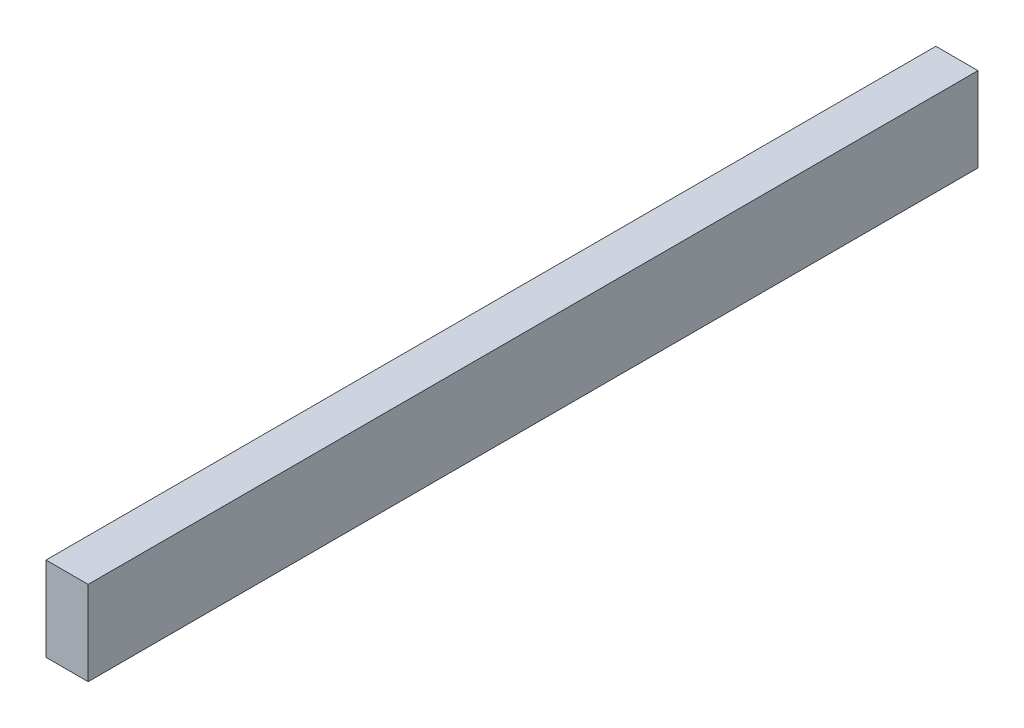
ISO-10303-21;
HEADER;
FILE_DESCRIPTION(('STEP AP214'),'2;1');
FILE_NAME('part.step','',(''),(''),'','','');
FILE_SCHEMA(('AUTOMOTIVE_DESIGN { 1 0 10303 214 1 1 1 1 }'));
ENDSEC;
DATA;
#1=APPLICATION_CONTEXT('core data for automotive mechanical design processes');
#2=APPLICATION_PROTOCOL_DEFINITION('international standard','automotive_design',2000,#1);
#3=PRODUCT_CONTEXT('',#1,'mechanical');
#4=PRODUCT('Part','Part','',(#3));
#5=PRODUCT_RELATED_PRODUCT_CATEGORY('part','',(#4));
#6=PRODUCT_DEFINITION_FORMATION('','',#4);
#7=PRODUCT_DEFINITION_CONTEXT('part definition',#1,'design');
#8=PRODUCT_DEFINITION('design','',#6,#7);
#9=PRODUCT_DEFINITION_SHAPE('','',#8);
#10=(LENGTH_UNIT() NAMED_UNIT(*) SI_UNIT(.MILLI.,.METRE.));
#11=(NAMED_UNIT(*) PLANE_ANGLE_UNIT() SI_UNIT($,.RADIAN.));
#12=(NAMED_UNIT(*) SI_UNIT($,.STERADIAN.) SOLID_ANGLE_UNIT());
#13=UNCERTAINTY_MEASURE_WITH_UNIT(LENGTH_MEASURE(1.E-05),#10,'distance_accuracy_value','');
#14=(GEOMETRIC_REPRESENTATION_CONTEXT(3) GLOBAL_UNCERTAINTY_ASSIGNED_CONTEXT((#13)) GLOBAL_UNIT_ASSIGNED_CONTEXT((#10,
#11,#12)) REPRESENTATION_CONTEXT('',''));
#15=CARTESIAN_POINT('',(0.,0.,0.));
#16=DIRECTION('',(0.,0.,1.));
#17=DIRECTION('',(1.,0.,0.));
#18=AXIS2_PLACEMENT_3D('',#15,#16,#17);
#19=CARTESIAN_POINT('',(10.,20.,422.2));
#20=DIRECTION('',(-1.,0.,0.));
#21=DIRECTION('',(0.,-1.,0.));
#22=AXIS2_PLACEMENT_3D('',#19,#20,#21);
#23=PLANE('',#22);
#24=DIRECTION('',(0.,1.,0.));
#25=VECTOR('',#24,1.);
#26=CARTESIAN_POINT('',(10.,20.,0.));
#27=LINE('',#26,#25);
#28=CARTESIAN_POINT('',(10.,-20.,0.));
#29=VERTEX_POINT('',#28);
#30=CARTESIAN_POINT('',(10.,20.,0.));
#31=VERTEX_POINT('',#30);
#32=EDGE_CURVE('E78',#29,#31,#27,.T.);
#33=ORIENTED_EDGE('',*,*,#32,.T.);
#34=DIRECTION('',(0.,0.,-1.));
#35=VECTOR('',#34,1.);
#36=CARTESIAN_POINT('',(10.,20.,422.2));
#37=LINE('',#36,#35);
#38=CARTESIAN_POINT('',(10.,20.,422.2));
#39=VERTEX_POINT('',#38);
#40=EDGE_CURVE('E11',#39,#31,#37,.T.);
#41=ORIENTED_EDGE('',*,*,#40,.F.);
#42=DIRECTION('',(0.,1.,0.));
#43=VECTOR('',#42,1.);
#44=CARTESIAN_POINT('',(10.,20.,422.2));
#45=LINE('',#44,#43);
#46=CARTESIAN_POINT('',(10.,-20.,422.2));
#47=VERTEX_POINT('',#46);
#48=EDGE_CURVE('E70',#47,#39,#45,.T.);
#49=ORIENTED_EDGE('',*,*,#48,.F.);
#50=DIRECTION('',(0.,0.,-1.));
#51=VECTOR('',#50,1.);
#52=CARTESIAN_POINT('',(10.,-20.,422.2));
#53=LINE('',#52,#51);
#54=EDGE_CURVE('E74',#47,#29,#53,.T.);
#55=ORIENTED_EDGE('',*,*,#54,.T.);
#56=EDGE_LOOP('',(#33,#41,#49,#55));
#57=FACE_BOUND('',#56,.T.);
#58=ADVANCED_FACE('F16',(#57),#23,.F.);
#59=CARTESIAN_POINT('',(-10.,20.,422.2));
#60=DIRECTION('',(0.,-1.,0.));
#61=DIRECTION('',(0.,0.,-1.));
#62=AXIS2_PLACEMENT_3D('',#59,#60,#61);
#63=PLANE('',#62);
#64=DIRECTION('',(-1.,0.,0.));
#65=VECTOR('',#64,1.);
#66=CARTESIAN_POINT('',(-10.,20.,0.));
#67=LINE('',#66,#65);
#68=CARTESIAN_POINT('',(-10.,20.,0.));
#69=VERTEX_POINT('',#68);
#70=EDGE_CURVE('E75',#31,#69,#67,.T.);
#71=ORIENTED_EDGE('',*,*,#70,.T.);
#72=DIRECTION('',(0.,0.,-1.));
#73=VECTOR('',#72,1.);
#74=CARTESIAN_POINT('',(-10.,20.,422.2));
#75=LINE('',#74,#73);
#76=CARTESIAN_POINT('',(-10.,20.,422.2));
#77=VERTEX_POINT('',#76);
#78=EDGE_CURVE('E24',#77,#69,#75,.T.);
#79=ORIENTED_EDGE('',*,*,#78,.F.);
#80=DIRECTION('',(-1.,0.,0.));
#81=VECTOR('',#80,1.);
#82=CARTESIAN_POINT('',(-10.,20.,422.2));
#83=LINE('',#82,#81);
#84=EDGE_CURVE('E62',#39,#77,#83,.T.);
#85=ORIENTED_EDGE('',*,*,#84,.F.);
#86=ORIENTED_EDGE('',*,*,#40,.T.);
#87=EDGE_LOOP('',(#71,#79,#85,#86));
#88=FACE_BOUND('',#87,.T.);
#89=ADVANCED_FACE('F69',(#88),#63,.F.);
#90=CARTESIAN_POINT('',(-10.,20.,422.2));
#91=DIRECTION('',(1.,0.,0.));
#92=DIRECTION('',(0.,1.,0.));
#93=AXIS2_PLACEMENT_3D('',#90,#91,#92);
#94=PLANE('',#93);
#95=DIRECTION('',(0.,-1.,0.));
#96=VECTOR('',#95,1.);
#97=CARTESIAN_POINT('',(-10.,20.,0.));
#98=LINE('',#97,#96);
#99=CARTESIAN_POINT('',(-10.,-20.,0.));
#100=VERTEX_POINT('',#99);
#101=EDGE_CURVE('E47',#69,#100,#98,.T.);
#102=ORIENTED_EDGE('',*,*,#101,.T.);
#103=DIRECTION('',(0.,0.,-1.));
#104=VECTOR('',#103,1.);
#105=CARTESIAN_POINT('',(-10.,-20.,422.2));
#106=LINE('',#105,#104);
#107=CARTESIAN_POINT('',(-10.,-20.,422.2));
#108=VERTEX_POINT('',#107);
#109=EDGE_CURVE('E71',#108,#100,#106,.T.);
#110=ORIENTED_EDGE('',*,*,#109,.F.);
#111=DIRECTION('',(0.,-1.,0.));
#112=VECTOR('',#111,1.);
#113=CARTESIAN_POINT('',(-10.,20.,422.2));
#114=LINE('',#113,#112);
#115=EDGE_CURVE('E65',#77,#108,#114,.T.);
#116=ORIENTED_EDGE('',*,*,#115,.F.);
#117=ORIENTED_EDGE('',*,*,#78,.T.);
#118=EDGE_LOOP('',(#102,#110,#116,#117));
#119=FACE_BOUND('',#118,.T.);
#120=ADVANCED_FACE('F73',(#119),#94,.F.);
#121=CARTESIAN_POINT('',(-10.,-20.,422.2));
#122=DIRECTION('',(0.,1.,0.));
#123=DIRECTION('',(0.,0.,1.));
#124=AXIS2_PLACEMENT_3D('',#121,#122,#123);
#125=PLANE('',#124);
#126=DIRECTION('',(1.,0.,0.));
#127=VECTOR('',#126,1.);
#128=CARTESIAN_POINT('',(-10.,-20.,0.));
#129=LINE('',#128,#127);
#130=EDGE_CURVE('E54',#100,#29,#129,.T.);
#131=ORIENTED_EDGE('',*,*,#130,.T.);
#132=ORIENTED_EDGE('',*,*,#54,.F.);
#133=DIRECTION('',(1.,0.,0.));
#134=VECTOR('',#133,1.);
#135=CARTESIAN_POINT('',(-10.,-20.,422.2));
#136=LINE('',#135,#134);
#137=EDGE_CURVE('E32',#108,#47,#136,.T.);
#138=ORIENTED_EDGE('',*,*,#137,.F.);
#139=ORIENTED_EDGE('',*,*,#109,.T.);
#140=EDGE_LOOP('',(#131,#132,#138,#139));
#141=FACE_BOUND('',#140,.T.);
#142=ADVANCED_FACE('F88',(#141),#125,.F.);
#143=CARTESIAN_POINT('',(0.,0.,422.2));
#144=DIRECTION('',(0.,0.,1.));
#145=DIRECTION('',(1.,0.,0.));
#146=AXIS2_PLACEMENT_3D('',#143,#144,#145);
#147=PLANE('',#146);
#148=ORIENTED_EDGE('',*,*,#48,.T.);
#149=ORIENTED_EDGE('',*,*,#84,.T.);
#150=ORIENTED_EDGE('',*,*,#115,.T.);
#151=ORIENTED_EDGE('',*,*,#137,.T.);
#152=EDGE_LOOP('',(#148,#149,#150,#151));
#153=FACE_BOUND('',#152,.T.);
#154=ADVANCED_FACE('F64',(#153),#147,.T.);
#155=CARTESIAN_POINT('',(0.,0.,0.));
#156=DIRECTION('',(0.,0.,1.));
#157=DIRECTION('',(1.,0.,0.));
#158=AXIS2_PLACEMENT_3D('',#155,#156,#157);
#159=PLANE('',#158);
#160=ORIENTED_EDGE('',*,*,#32,.F.);
#161=ORIENTED_EDGE('',*,*,#130,.F.);
#162=ORIENTED_EDGE('',*,*,#101,.F.);
#163=ORIENTED_EDGE('',*,*,#70,.F.);
#164=EDGE_LOOP('',(#160,#161,#162,#163));
#165=FACE_BOUND('',#164,.T.);
#166=ADVANCED_FACE('F90',(#165),#159,.F.);
#167=CLOSED_SHELL('',(#58,#89,#120,#142,#154,#166));
#168=MANIFOLD_SOLID_BREP('B1',#167);
#169=ADVANCED_BREP_SHAPE_REPRESENTATION('',(#18,#168),#14);
#170=SHAPE_DEFINITION_REPRESENTATION(#9,#169);
ENDSEC;
END-ISO-10303-21;
